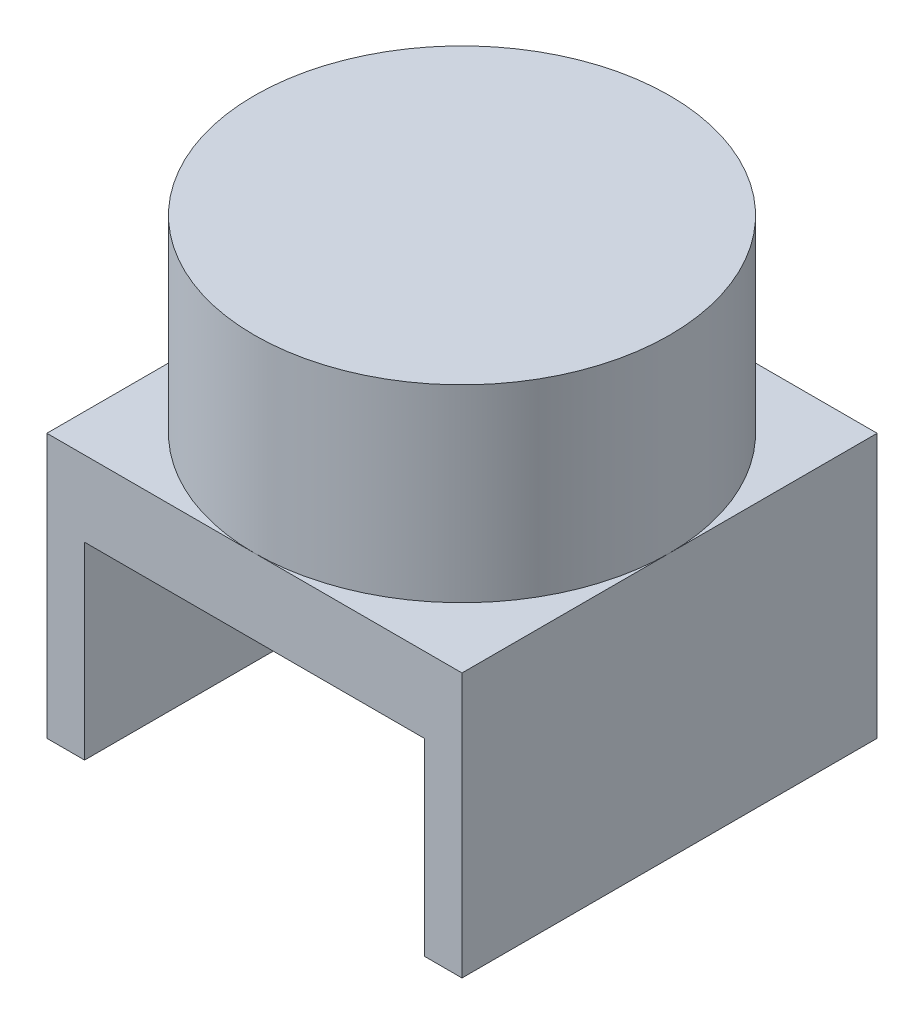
from build123d import *

# Parameters (mm, degrees)
SKETCH1_R           = 55
BOSS_EXTRUDE1_DEPTH = 50
SKETCH2_W           = 110
SKETCH2_H           = 110
BOSS_EXTRUDE2_DEPTH = 20
SKETCH3_W           = 10
SKETCH3_H           = 110
BOSS_EXTRUDE3_DEPTH = 50


with BuildPart() as part:
    # Sketch1 → Boss-Extrude1 (new body)
    with BuildSketch(Plane(origin=(0, 0, 0), x_dir=(1, 0, 0), z_dir=(0, 1, 0))):
        with Locations(Location((0, 0, 0), (0, 0, 270))):
            Circle(SKETCH1_R)
    extrude(amount=BOSS_EXTRUDE1_DEPTH)

    # Sketch2 → Boss-Extrude2 (add)
    with BuildSketch(Plane(origin=(0, 0, 0), x_dir=(-1, 0, 0), z_dir=(0, -1, 0))):
        Rectangle(SKETCH2_W, SKETCH2_H)
    extrude(amount=BOSS_EXTRUDE2_DEPTH)

    # Sketch3 → Boss-Extrude3 (add)
    with BuildSketch(Plane(origin=(0, -20, 0), x_dir=(-1, 0, 0), z_dir=(0, -1, 0))):
        with Locations((50, 0)):
            Rectangle(SKETCH3_W, SKETCH3_H)
        with Locations((-50, 0)):
            Rectangle(SKETCH3_W, SKETCH3_H)
    extrude(amount=BOSS_EXTRUDE3_DEPTH)


solid = part.part
